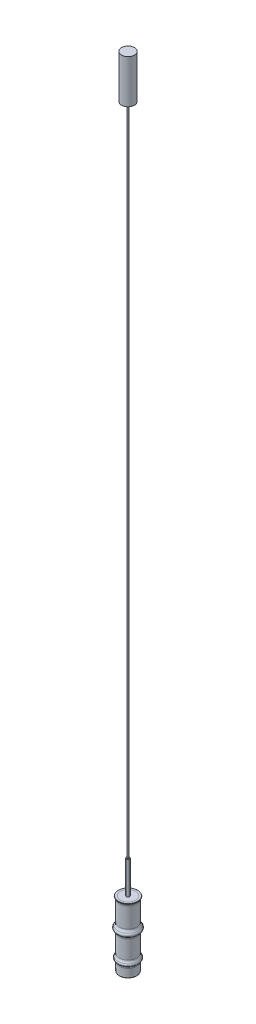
from build123d import *

# Parameters (mm, degrees)
CROQUIS2_R              = 125
SALIENTE_EXTRUIR1_DEPTH = 10
CROQUIS5_R              = 7
SALIENTE_EXTRUIR3_DEPTH = 20
BARRER1_PROFILE_R       = 7
CROQUIS21_R             = 30
SALIENTE_EXTRUIR4_DEPTH = 263
REDONDEO1_R             = 15
REDONDEO2_R             = 1
CROQUIS24_R             = 35
SALIENTE_EXTRUIR5_DEPTH = 3
CROQUIS25_R             = 7.5
SALIENTE_EXTRUIR6_DEPTH = 150
CROQUIS26_R             = 3.5
SALIENTE_EXTRUIR7_DEPTH = 3000
CROQUIS27_R             = 7.5
SALIENTE_EXTRUIR8_DEPTH = 15
CROQUIS28_R             = 30
SALIENTE_EXTRUIR9_DEPTH = 200


with BuildPart() as part:
    # Croquis2 → Saliente-Extruir1 (new body)
    with BuildSketch(Plane(origin=(0, 0, 0), x_dir=(1, 0, 0), z_dir=(0, 1, 0))):
        with Locations(Location((0, 0, 0), (0, 0, 270))):
            Circle(CROQUIS2_R)
    extrude(amount=SALIENTE_EXTRUIR1_DEPTH)


with BuildPart() as body_2:
    # Croquis5 → Saliente-Extruir3 (new body)
    with BuildSketch(Plane(origin=(0, 10, 0), x_dir=(1, 0, 0), z_dir=(0, 1, 0))):
        with Locations(Location((0, 0, 0), (0, 0, 270))):
            Circle(CROQUIS5_R)
    extrude(amount=SALIENTE_EXTRUIR3_DEPTH)

    # Barrer1: sweep along a path in Croquis6
    with BuildLine(Plane.XY) as barrer1_path:
        ThreePointArc((100, 393), (0, 493), (-100, 393))
        Line((-100, 393), (-100, 130))
        ThreePointArc((-100, 130), (0, 30), (100, 130))
    # Barrer1 profile (on start of the path) → Barrer1 (sweep)
    with BuildSketch(Plane(origin=(100, 393, 0), x_dir=(0, 0, 1), z_dir=(0, 1, 0))):
        Circle(BARRER1_PROFILE_R)
    sweep(path=barrer1_path.line)


with BuildPart() as body_3:
    # Croquis3 → Revoluci_n1 (revolve)
    with BuildSketch(Plane.XY, mode=Mode.PRIVATE) as revoluci_n1_sk:
        with BuildLine():
            Line((140, 406.5), (140, 296.5))
            ThreePointArc((140, 296.5), (150, 286.5), (140, 276.5))
            Line((140, 276.5), (140, 174))
            ThreePointArc((140, 174), (147.5, 166.5), (140, 159))
            Line((140, 159), (140, 111.5))
            Line((140, 111.5), (135, 111.5))
            Line((135, 111.5), (135, 411.5))
            Line((135, 411.5), (145, 411.5))
            ThreePointArc((145, 411.5), (143.535533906, 407.964466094), (140, 406.5))
        make_face()
    revolve(revoluci_n1_sk.sketch.rotate(Axis((100, 130, 0), (0, 1, 0)), 90), axis=Axis((100, 130, 0), (0, 1, 0)))

    # Redondeo1
    redondeo1_edges = [body_3.edges().sort_by_distance(p)[0] for p in [
        (100, 406.5, 40),
        (100, 296.5, 40),
        (100, 276.5, 40),
        (100, 174, 40),
        (100, 159, 40),
    ]]
    fillet(redondeo1_edges, radius=REDONDEO1_R)

    # Redondeo2
    redondeo2_edges = [body_3.edges().sort_by_distance(p)[0] for p in [
        (100, 111.5, 40),
        (100, 411.5, 45),
    ]]
    fillet(redondeo2_edges, radius=REDONDEO2_R)


with BuildPart() as body_4:
    # Croquis21 → Saliente-Extruir4 (new body)
    with BuildSketch(Plane(origin=(0, 393, 0), x_dir=(-1, 0, 0), z_dir=(0, -1, 0))):
        with Locations((-100, 0)):
            Circle(CROQUIS21_R)
    extrude(amount=SALIENTE_EXTRUIR4_DEPTH)


with BuildPart() as body_3_2:
    # Croquis24 → Saliente-Extruir5 (new body)
    with BuildSketch(Plane(origin=(0, 411.5, 0), x_dir=(1, 0, 0), z_dir=(0, 1, 0))):
        with Locations(Location((100, 0, 0), (0, 0, 270))):
            Circle(CROQUIS24_R)
    extrude(amount=-SALIENTE_EXTRUIR5_DEPTH)


with BuildPart() as body_4_2:
    # Croquis25 → Saliente-Extruir6 (new body)
    with BuildSketch(Plane(origin=(0, 411.5, 0), x_dir=(1, 0, 0), z_dir=(0, 1, 0))):
        with Locations(Location((100, 0, 0), (0, 0, 270))):
            Circle(CROQUIS25_R)
    extrude(amount=SALIENTE_EXTRUIR6_DEPTH)


with BuildPart() as body_5:
    # Croquis26 → Saliente-Extruir7 (new body)
    with BuildSketch(Plane(origin=(0, 561.5, 0), x_dir=(1, 0, 0), z_dir=(0, 1, 0))):
        with Locations(Location((100, 0, 0), (0, 0, 270))):
            Circle(CROQUIS26_R)
    extrude(amount=SALIENTE_EXTRUIR7_DEPTH)


with BuildPart() as body_6:
    # Croquis27 → Saliente-Extruir8 (new body)
    with BuildSketch(Plane(origin=(0, 3561.5, 0), x_dir=(1, 0, 0), z_dir=(0, 1, 0))):
        with Locations(Location((100, 0, 0), (0, 0, 270))):
            Circle(CROQUIS27_R)
    extrude(amount=SALIENTE_EXTRUIR8_DEPTH)


with BuildPart() as body_7:
    # Croquis28 → Saliente-Extruir9 (new body)
    with BuildSketch(Plane(origin=(0, 3576.5, 0), x_dir=(1, 0, 0), z_dir=(0, 1, 0))):
        with Locations(Location((100, 0, 0), (0, 0, 270))):
            Circle(CROQUIS28_R)
    extrude(amount=SALIENTE_EXTRUIR9_DEPTH)


solid = Compound([body_3.part, body_4.part, body_3_2.part, body_4_2.part, body_5.part, body_6.part, body_7.part])
